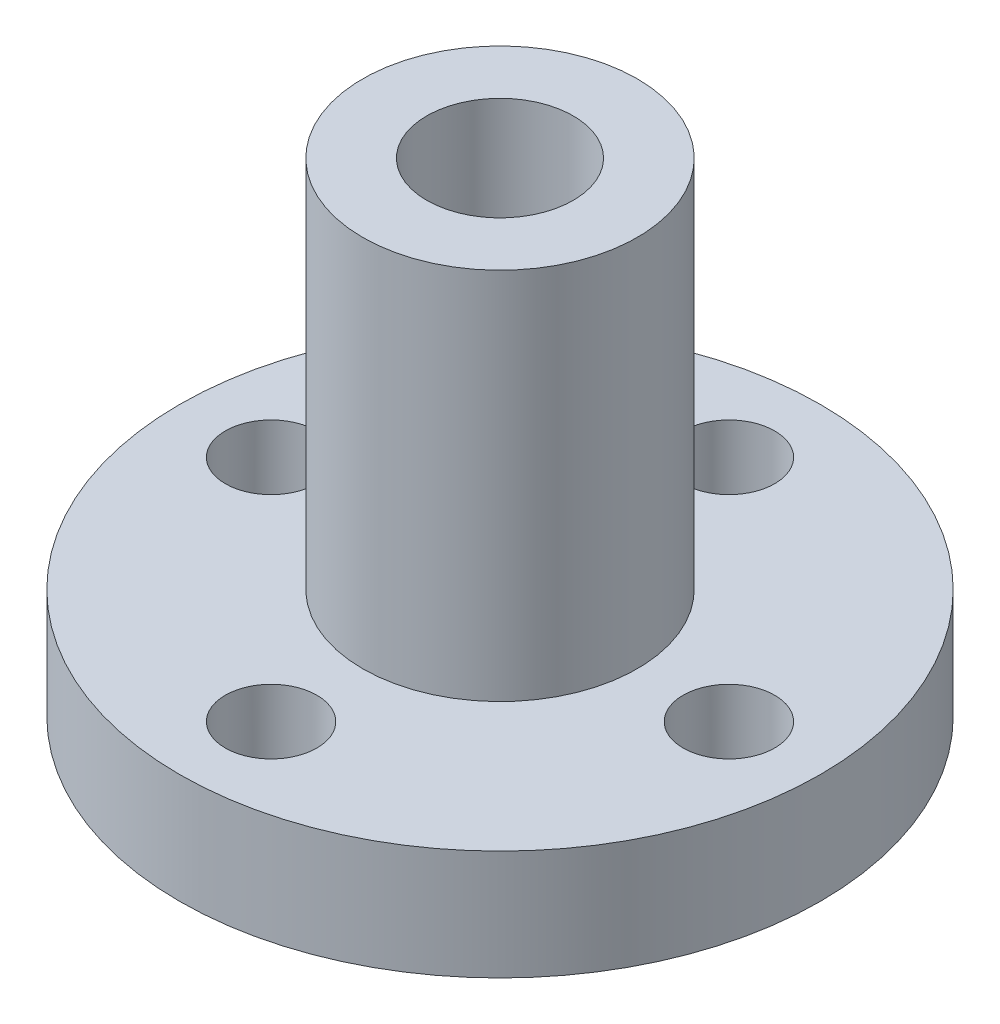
ISO-10303-21;
HEADER;
FILE_DESCRIPTION(('STEP AP214'),'2;1');
FILE_NAME('part.step','',(''),(''),'','','');
FILE_SCHEMA(('AUTOMOTIVE_DESIGN { 1 0 10303 214 1 1 1 1 }'));
ENDSEC;
DATA;
#1=APPLICATION_CONTEXT('core data for automotive mechanical design processes');
#2=APPLICATION_PROTOCOL_DEFINITION('international standard','automotive_design',2000,#1);
#3=PRODUCT_CONTEXT('',#1,'mechanical');
#4=PRODUCT('Part','Part','',(#3));
#5=PRODUCT_RELATED_PRODUCT_CATEGORY('part','',(#4));
#6=PRODUCT_DEFINITION_FORMATION('','',#4);
#7=PRODUCT_DEFINITION_CONTEXT('part definition',#1,'design');
#8=PRODUCT_DEFINITION('design','',#6,#7);
#9=PRODUCT_DEFINITION_SHAPE('','',#8);
#10=(LENGTH_UNIT() NAMED_UNIT(*) SI_UNIT(.MILLI.,.METRE.));
#11=(NAMED_UNIT(*) PLANE_ANGLE_UNIT() SI_UNIT($,.RADIAN.));
#12=(NAMED_UNIT(*) SI_UNIT($,.STERADIAN.) SOLID_ANGLE_UNIT());
#13=UNCERTAINTY_MEASURE_WITH_UNIT(LENGTH_MEASURE(1.E-05),#10,'distance_accuracy_value','');
#14=(GEOMETRIC_REPRESENTATION_CONTEXT(3) GLOBAL_UNCERTAINTY_ASSIGNED_CONTEXT((#13)) GLOBAL_UNIT_ASSIGNED_CONTEXT((#10,
#11,#12)) REPRESENTATION_CONTEXT('',''));
#15=CARTESIAN_POINT('',(0.,0.,0.));
#16=DIRECTION('',(0.,0.,1.));
#17=DIRECTION('',(1.,0.,0.));
#18=AXIS2_PLACEMENT_3D('',#15,#16,#17);
#19=CARTESIAN_POINT('',(0.,6.,0.));
#20=DIRECTION('',(0.,-1.,0.));
#21=DIRECTION('',(0.,0.,-1.));
#22=AXIS2_PLACEMENT_3D('',#19,#20,#21);
#23=CYLINDRICAL_SURFACE('',#22,17.5);
#24=CARTESIAN_POINT('',(0.,6.,0.));
#25=DIRECTION('',(0.,1.,0.));
#26=DIRECTION('',(0.,0.,1.));
#27=AXIS2_PLACEMENT_3D('',#24,#25,#26);
#28=CIRCLE('',#27,17.5);
#29=CARTESIAN_POINT('',(0.,6.,17.5));
#30=VERTEX_POINT('',#29);
#31=EDGE_CURVE('E46',#30,#30,#28,.T.);
#32=ORIENTED_EDGE('',*,*,#31,.F.);
#33=EDGE_LOOP('',(#32));
#34=FACE_BOUND('',#33,.T.);
#35=CARTESIAN_POINT('',(0.,0.,0.));
#36=DIRECTION('',(0.,1.,0.));
#37=DIRECTION('',(0.,0.,1.));
#38=AXIS2_PLACEMENT_3D('',#35,#36,#37);
#39=CIRCLE('',#38,17.5);
#40=CARTESIAN_POINT('',(0.,0.,17.5));
#41=VERTEX_POINT('',#40);
#42=EDGE_CURVE('E51',#41,#41,#39,.T.);
#43=ORIENTED_EDGE('',*,*,#42,.T.);
#44=EDGE_LOOP('',(#43));
#45=FACE_BOUND('',#44,.T.);
#46=ADVANCED_FACE('F39',(#34,#45),#23,.T.);
#47=CARTESIAN_POINT('',(0.,6.,0.));
#48=DIRECTION('',(0.,1.,0.));
#49=DIRECTION('',(0.,0.,1.));
#50=AXIS2_PLACEMENT_3D('',#47,#48,#49);
#51=PLANE('',#50);
#52=CARTESIAN_POINT('',(-12.5,6.,0.));
#53=DIRECTION('',(0.,1.,0.));
#54=DIRECTION('',(1.,0.,0.));
#55=AXIS2_PLACEMENT_3D('',#52,#53,#54);
#56=CIRCLE('',#55,2.5);
#57=CARTESIAN_POINT('',(-10.,6.,0.));
#58=VERTEX_POINT('',#57);
#59=EDGE_CURVE('E69',#58,#58,#56,.T.);
#60=ORIENTED_EDGE('',*,*,#59,.F.);
#61=EDGE_LOOP('',(#60));
#62=FACE_BOUND('',#61,.T.);
#63=CARTESIAN_POINT('',(0.,6.,12.5));
#64=DIRECTION('',(0.,1.,0.));
#65=DIRECTION('',(0.,0.,-1.));
#66=AXIS2_PLACEMENT_3D('',#63,#64,#65);
#67=CIRCLE('',#66,2.5);
#68=CARTESIAN_POINT('',(0.,6.,10.));
#69=VERTEX_POINT('',#68);
#70=EDGE_CURVE('E123',#69,#69,#67,.T.);
#71=ORIENTED_EDGE('',*,*,#70,.F.);
#72=EDGE_LOOP('',(#71));
#73=FACE_BOUND('',#72,.T.);
#74=CARTESIAN_POINT('',(12.5,6.,-1.30930550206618E-13));
#75=DIRECTION('',(0.,1.,0.));
#76=DIRECTION('',(-1.,0.,0.));
#77=AXIS2_PLACEMENT_3D('',#74,#75,#76);
#78=CIRCLE('',#77,2.5);
#79=CARTESIAN_POINT('',(10.,6.,-1.04744440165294E-13));
#80=VERTEX_POINT('',#79);
#81=EDGE_CURVE('E78',#80,#80,#78,.T.);
#82=ORIENTED_EDGE('',*,*,#81,.F.);
#83=EDGE_LOOP('',(#82));
#84=FACE_BOUND('',#83,.T.);
#85=CARTESIAN_POINT('',(0.,6.,-12.5));
#86=DIRECTION('',(0.,1.,0.));
#87=DIRECTION('',(0.,0.,1.));
#88=AXIS2_PLACEMENT_3D('',#85,#86,#87);
#89=CIRCLE('',#88,2.5);
#90=CARTESIAN_POINT('',(0.,6.,-10.));
#91=VERTEX_POINT('',#90);
#92=EDGE_CURVE('E65',#91,#91,#89,.T.);
#93=ORIENTED_EDGE('',*,*,#92,.F.);
#94=EDGE_LOOP('',(#93));
#95=FACE_BOUND('',#94,.T.);
#96=CARTESIAN_POINT('',(0.,6.,0.));
#97=DIRECTION('',(0.,1.,0.));
#98=DIRECTION('',(0.,0.,1.));
#99=AXIS2_PLACEMENT_3D('',#96,#97,#98);
#100=CIRCLE('',#99,7.5);
#101=CARTESIAN_POINT('',(0.,6.,7.5));
#102=VERTEX_POINT('',#101);
#103=EDGE_CURVE('E10',#102,#102,#100,.T.);
#104=ORIENTED_EDGE('',*,*,#103,.F.);
#105=EDGE_LOOP('',(#104));
#106=FACE_BOUND('',#105,.T.);
#107=ORIENTED_EDGE('',*,*,#31,.T.);
#108=EDGE_LOOP('',(#107));
#109=FACE_BOUND('',#108,.T.);
#110=ADVANCED_FACE('F104',(#62,#73,#84,#95,#106,#109),#51,.T.);
#111=CARTESIAN_POINT('',(0.,0.,0.));
#112=DIRECTION('',(0.,1.,0.));
#113=DIRECTION('',(0.,0.,1.));
#114=AXIS2_PLACEMENT_3D('',#111,#112,#113);
#115=PLANE('',#114);
#116=CARTESIAN_POINT('',(-12.5,0.,0.));
#117=DIRECTION('',(0.,1.,0.));
#118=DIRECTION('',(0.,0.,1.));
#119=AXIS2_PLACEMENT_3D('',#116,#117,#118);
#120=CIRCLE('',#119,2.5);
#121=CARTESIAN_POINT('',(-12.5,0.,2.50000000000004));
#122=VERTEX_POINT('',#121);
#123=EDGE_CURVE('E45',#122,#122,#120,.T.);
#124=ORIENTED_EDGE('',*,*,#123,.T.);
#125=EDGE_LOOP('',(#124));
#126=FACE_BOUND('',#125,.T.);
#127=CARTESIAN_POINT('',(0.,0.,12.5));
#128=DIRECTION('',(0.,1.,0.));
#129=DIRECTION('',(0.,0.,1.));
#130=AXIS2_PLACEMENT_3D('',#127,#128,#129);
#131=CIRCLE('',#130,2.5);
#132=CARTESIAN_POINT('',(0.,0.,15.));
#133=VERTEX_POINT('',#132);
#134=EDGE_CURVE('E68',#133,#133,#131,.T.);
#135=ORIENTED_EDGE('',*,*,#134,.T.);
#136=EDGE_LOOP('',(#135));
#137=FACE_BOUND('',#136,.T.);
#138=CARTESIAN_POINT('',(12.5,0.,-1.30930550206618E-13));
#139=DIRECTION('',(0.,1.,0.));
#140=DIRECTION('',(0.,0.,1.));
#141=AXIS2_PLACEMENT_3D('',#138,#139,#140);
#142=CIRCLE('',#141,2.5);
#143=CARTESIAN_POINT('',(12.5,0.,2.49999999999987));
#144=VERTEX_POINT('',#143);
#145=EDGE_CURVE('E63',#144,#144,#142,.T.);
#146=ORIENTED_EDGE('',*,*,#145,.T.);
#147=EDGE_LOOP('',(#146));
#148=FACE_BOUND('',#147,.T.);
#149=CARTESIAN_POINT('',(0.,0.,-12.5));
#150=DIRECTION('',(0.,1.,0.));
#151=DIRECTION('',(0.,0.,1.));
#152=AXIS2_PLACEMENT_3D('',#149,#150,#151);
#153=CIRCLE('',#152,2.5);
#154=CARTESIAN_POINT('',(0.,0.,-10.));
#155=VERTEX_POINT('',#154);
#156=EDGE_CURVE('E56',#155,#155,#153,.T.);
#157=ORIENTED_EDGE('',*,*,#156,.T.);
#158=EDGE_LOOP('',(#157));
#159=FACE_BOUND('',#158,.T.);
#160=CARTESIAN_POINT('',(0.,0.,0.));
#161=DIRECTION('',(0.,1.,0.));
#162=DIRECTION('',(0.,0.,1.));
#163=AXIS2_PLACEMENT_3D('',#160,#161,#162);
#164=CIRCLE('',#163,4.);
#165=CARTESIAN_POINT('',(0.,0.,4.));
#166=VERTEX_POINT('',#165);
#167=EDGE_CURVE('E81',#166,#166,#164,.T.);
#168=ORIENTED_EDGE('',*,*,#167,.T.);
#169=EDGE_LOOP('',(#168));
#170=FACE_BOUND('',#169,.T.);
#171=ORIENTED_EDGE('',*,*,#42,.F.);
#172=EDGE_LOOP('',(#171));
#173=FACE_BOUND('',#172,.T.);
#174=ADVANCED_FACE('F96',(#126,#137,#148,#159,#170,#173),#115,.F.);
#175=CARTESIAN_POINT('',(0.,26.4,0.));
#176=DIRECTION('',(0.,-1.,0.));
#177=DIRECTION('',(0.,0.,-1.));
#178=AXIS2_PLACEMENT_3D('',#175,#176,#177);
#179=CYLINDRICAL_SURFACE('',#178,7.5);
#180=CARTESIAN_POINT('',(0.,26.4,0.));
#181=DIRECTION('',(0.,1.,0.));
#182=DIRECTION('',(0.,0.,1.));
#183=AXIS2_PLACEMENT_3D('',#180,#181,#182);
#184=CIRCLE('',#183,7.5);
#185=CARTESIAN_POINT('',(0.,26.4,7.5));
#186=VERTEX_POINT('',#185);
#187=EDGE_CURVE('E53',#186,#186,#184,.T.);
#188=ORIENTED_EDGE('',*,*,#187,.F.);
#189=EDGE_LOOP('',(#188));
#190=FACE_BOUND('',#189,.T.);
#191=ORIENTED_EDGE('',*,*,#103,.T.);
#192=EDGE_LOOP('',(#191));
#193=FACE_BOUND('',#192,.T.);
#194=ADVANCED_FACE('F94',(#190,#193),#179,.T.);
#195=CARTESIAN_POINT('',(0.,26.4,0.));
#196=DIRECTION('',(0.,1.,0.));
#197=DIRECTION('',(0.,0.,1.));
#198=AXIS2_PLACEMENT_3D('',#195,#196,#197);
#199=PLANE('',#198);
#200=CARTESIAN_POINT('',(0.,26.4,0.));
#201=DIRECTION('',(0.,1.,0.));
#202=DIRECTION('',(0.,0.,1.));
#203=AXIS2_PLACEMENT_3D('',#200,#201,#202);
#204=CIRCLE('',#203,4.);
#205=CARTESIAN_POINT('',(0.,26.4,4.));
#206=VERTEX_POINT('',#205);
#207=EDGE_CURVE('E61',#206,#206,#204,.T.);
#208=ORIENTED_EDGE('',*,*,#207,.F.);
#209=EDGE_LOOP('',(#208));
#210=FACE_BOUND('',#209,.T.);
#211=ORIENTED_EDGE('',*,*,#187,.T.);
#212=EDGE_LOOP('',(#211));
#213=FACE_BOUND('',#212,.T.);
#214=ADVANCED_FACE('F90',(#210,#213),#199,.T.);
#215=CARTESIAN_POINT('',(0.,0.,0.));
#216=DIRECTION('',(0.,1.,0.));
#217=DIRECTION('',(0.,0.,1.));
#218=AXIS2_PLACEMENT_3D('',#215,#216,#217);
#219=CYLINDRICAL_SURFACE('',#218,4.);
#220=ORIENTED_EDGE('',*,*,#167,.F.);
#221=EDGE_LOOP('',(#220));
#222=FACE_BOUND('',#221,.T.);
#223=ORIENTED_EDGE('',*,*,#207,.T.);
#224=EDGE_LOOP('',(#223));
#225=FACE_BOUND('',#224,.T.);
#226=ADVANCED_FACE('F89',(#222,#225),#219,.F.);
#227=CARTESIAN_POINT('',(0.,-4.,-12.5));
#228=DIRECTION('',(0.,1.,0.));
#229=DIRECTION('',(0.,0.,1.));
#230=AXIS2_PLACEMENT_3D('',#227,#228,#229);
#231=CYLINDRICAL_SURFACE('',#230,2.5);
#232=ORIENTED_EDGE('',*,*,#92,.T.);
#233=EDGE_LOOP('',(#232));
#234=FACE_BOUND('',#233,.T.);
#235=ORIENTED_EDGE('',*,*,#156,.F.);
#236=EDGE_LOOP('',(#235));
#237=FACE_BOUND('',#236,.T.);
#238=ADVANCED_FACE('F146',(#234,#237),#231,.F.);
#239=CARTESIAN_POINT('',(12.5,-4.,-1.30930550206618E-13));
#240=DIRECTION('',(0.,1.,0.));
#241=DIRECTION('',(0.,0.,1.));
#242=AXIS2_PLACEMENT_3D('',#239,#240,#241);
#243=CYLINDRICAL_SURFACE('',#242,2.5);
#244=ORIENTED_EDGE('',*,*,#81,.T.);
#245=EDGE_LOOP('',(#244));
#246=FACE_BOUND('',#245,.T.);
#247=ORIENTED_EDGE('',*,*,#145,.F.);
#248=EDGE_LOOP('',(#247));
#249=FACE_BOUND('',#248,.T.);
#250=ADVANCED_FACE('F145',(#246,#249),#243,.F.);
#251=CARTESIAN_POINT('',(0.,-4.,12.5));
#252=DIRECTION('',(0.,1.,0.));
#253=DIRECTION('',(0.,0.,1.));
#254=AXIS2_PLACEMENT_3D('',#251,#252,#253);
#255=CYLINDRICAL_SURFACE('',#254,2.5);
#256=ORIENTED_EDGE('',*,*,#70,.T.);
#257=EDGE_LOOP('',(#256));
#258=FACE_BOUND('',#257,.T.);
#259=ORIENTED_EDGE('',*,*,#134,.F.);
#260=EDGE_LOOP('',(#259));
#261=FACE_BOUND('',#260,.T.);
#262=ADVANCED_FACE('F139',(#258,#261),#255,.F.);
#263=CARTESIAN_POINT('',(-12.5,-4.,0.));
#264=DIRECTION('',(0.,1.,0.));
#265=DIRECTION('',(0.,0.,1.));
#266=AXIS2_PLACEMENT_3D('',#263,#264,#265);
#267=CYLINDRICAL_SURFACE('',#266,2.5);
#268=ORIENTED_EDGE('',*,*,#59,.T.);
#269=EDGE_LOOP('',(#268));
#270=FACE_BOUND('',#269,.T.);
#271=ORIENTED_EDGE('',*,*,#123,.F.);
#272=EDGE_LOOP('',(#271));
#273=FACE_BOUND('',#272,.T.);
#274=ADVANCED_FACE('F135',(#270,#273),#267,.F.);
#275=CLOSED_SHELL('',(#46,#110,#174,#194,#214,#226,#238,#250,#262,#274));
#276=MANIFOLD_SOLID_BREP('B2',#275);
#277=ADVANCED_BREP_SHAPE_REPRESENTATION('',(#18,#276),#14);
#278=SHAPE_DEFINITION_REPRESENTATION(#9,#277);
ENDSEC;
END-ISO-10303-21;
